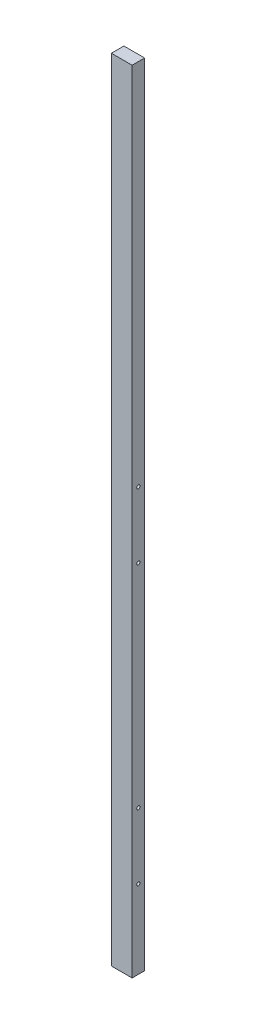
ISO-10303-21;
HEADER;
FILE_DESCRIPTION(('STEP AP214'),'2;1');
FILE_NAME('part.step','',(''),(''),'','','');
FILE_SCHEMA(('AUTOMOTIVE_DESIGN { 1 0 10303 214 1 1 1 1 }'));
ENDSEC;
DATA;
#1=APPLICATION_CONTEXT('core data for automotive mechanical design processes');
#2=APPLICATION_PROTOCOL_DEFINITION('international standard','automotive_design',2000,#1);
#3=PRODUCT_CONTEXT('',#1,'mechanical');
#4=PRODUCT('Part','Part','',(#3));
#5=PRODUCT_RELATED_PRODUCT_CATEGORY('part','',(#4));
#6=PRODUCT_DEFINITION_FORMATION('','',#4);
#7=PRODUCT_DEFINITION_CONTEXT('part definition',#1,'design');
#8=PRODUCT_DEFINITION('design','',#6,#7);
#9=PRODUCT_DEFINITION_SHAPE('','',#8);
#10=(LENGTH_UNIT() NAMED_UNIT(*) SI_UNIT(.MILLI.,.METRE.));
#11=(NAMED_UNIT(*) PLANE_ANGLE_UNIT() SI_UNIT($,.RADIAN.));
#12=(NAMED_UNIT(*) SI_UNIT($,.STERADIAN.) SOLID_ANGLE_UNIT());
#13=UNCERTAINTY_MEASURE_WITH_UNIT(LENGTH_MEASURE(1.E-05),#10,'distance_accuracy_value','');
#14=(GEOMETRIC_REPRESENTATION_CONTEXT(3) GLOBAL_UNCERTAINTY_ASSIGNED_CONTEXT((#13)) GLOBAL_UNIT_ASSIGNED_CONTEXT((#10,
#11,#12)) REPRESENTATION_CONTEXT('',''));
#15=CARTESIAN_POINT('',(0.,0.,0.));
#16=DIRECTION('',(0.,0.,1.));
#17=DIRECTION('',(1.,0.,0.));
#18=AXIS2_PLACEMENT_3D('',#15,#16,#17);
#19=CARTESIAN_POINT('',(0.,0.,38.));
#20=DIRECTION('',(1.,0.,0.));
#21=DIRECTION('',(0.,0.,-1.));
#22=AXIS2_PLACEMENT_3D('',#19,#20,#21);
#23=PLANE('',#22);
#24=CARTESIAN_POINT('',(0.,238.,18.9999999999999));
#25=DIRECTION('',(1.,0.,0.));
#26=DIRECTION('',(0.,0.,-1.));
#27=AXIS2_PLACEMENT_3D('',#24,#25,#26);
#28=CIRCLE('',#27,5.);
#29=CARTESIAN_POINT('',(0.,238.,13.9999999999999));
#30=VERTEX_POINT('',#29);
#31=EDGE_CURVE('E99',#30,#30,#28,.F.);
#32=ORIENTED_EDGE('',*,*,#31,.F.);
#33=EDGE_LOOP('',(#32));
#34=FACE_BOUND('',#33,.T.);
#35=CARTESIAN_POINT('',(0.,437.999999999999,18.9999999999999));
#36=DIRECTION('',(1.,0.,0.));
#37=DIRECTION('',(0.,0.,-1.));
#38=AXIS2_PLACEMENT_3D('',#35,#36,#37);
#39=CIRCLE('',#38,5.);
#40=CARTESIAN_POINT('',(0.,437.999999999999,13.9999999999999));
#41=VERTEX_POINT('',#40);
#42=EDGE_CURVE('E123',#41,#41,#39,.F.);
#43=ORIENTED_EDGE('',*,*,#42,.F.);
#44=EDGE_LOOP('',(#43));
#45=FACE_BOUND('',#44,.T.);
#46=CARTESIAN_POINT('',(0.,1082.,18.9999999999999));
#47=DIRECTION('',(1.,0.,0.));
#48=DIRECTION('',(0.,0.,-1.));
#49=AXIS2_PLACEMENT_3D('',#46,#47,#48);
#50=CIRCLE('',#49,5.);
#51=CARTESIAN_POINT('',(0.,1082.,13.9999999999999));
#52=VERTEX_POINT('',#51);
#53=EDGE_CURVE('E117',#52,#52,#50,.F.);
#54=ORIENTED_EDGE('',*,*,#53,.F.);
#55=EDGE_LOOP('',(#54));
#56=FACE_BOUND('',#55,.T.);
#57=CARTESIAN_POINT('',(0.,1282.,18.9999999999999));
#58=DIRECTION('',(1.,0.,0.));
#59=DIRECTION('',(0.,0.,-1.));
#60=AXIS2_PLACEMENT_3D('',#57,#58,#59);
#61=CIRCLE('',#60,5.);
#62=CARTESIAN_POINT('',(0.,1282.,13.9999999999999));
#63=VERTEX_POINT('',#62);
#64=EDGE_CURVE('E110',#63,#63,#61,.F.);
#65=ORIENTED_EDGE('',*,*,#64,.F.);
#66=EDGE_LOOP('',(#65));
#67=FACE_BOUND('',#66,.T.);
#68=DIRECTION('',(0.,-1.,0.));
#69=VECTOR('',#68,1.);
#70=CARTESIAN_POINT('',(0.,0.,0.));
#71=LINE('',#70,#69);
#72=CARTESIAN_POINT('',(0.,2400.,0.));
#73=VERTEX_POINT('',#72);
#74=CARTESIAN_POINT('',(0.,0.,0.));
#75=VERTEX_POINT('',#74);
#76=EDGE_CURVE('E96',#73,#75,#71,.T.);
#77=ORIENTED_EDGE('',*,*,#76,.T.);
#78=DIRECTION('',(0.,0.,-1.));
#79=VECTOR('',#78,1.);
#80=CARTESIAN_POINT('',(0.,0.,38.));
#81=LINE('',#80,#79);
#82=CARTESIAN_POINT('',(0.,0.,38.));
#83=VERTEX_POINT('',#82);
#84=EDGE_CURVE('E11',#83,#75,#81,.T.);
#85=ORIENTED_EDGE('',*,*,#84,.F.);
#86=DIRECTION('',(0.,-1.,0.));
#87=VECTOR('',#86,1.);
#88=CARTESIAN_POINT('',(0.,0.,38.));
#89=LINE('',#88,#87);
#90=CARTESIAN_POINT('',(0.,2400.,38.));
#91=VERTEX_POINT('',#90);
#92=EDGE_CURVE('E84',#91,#83,#89,.T.);
#93=ORIENTED_EDGE('',*,*,#92,.F.);
#94=DIRECTION('',(0.,0.,-1.));
#95=VECTOR('',#94,1.);
#96=CARTESIAN_POINT('',(0.,2400.,38.));
#97=LINE('',#96,#95);
#98=EDGE_CURVE('E92',#91,#73,#97,.T.);
#99=ORIENTED_EDGE('',*,*,#98,.T.);
#100=EDGE_LOOP('',(#77,#85,#93,#99));
#101=FACE_BOUND('',#100,.T.);
#102=ADVANCED_FACE('F33',(#34,#45,#56,#67,#101),#23,.F.);
#103=CARTESIAN_POINT('',(0.,0.,38.));
#104=DIRECTION('',(0.,1.,0.));
#105=DIRECTION('',(0.,0.,1.));
#106=AXIS2_PLACEMENT_3D('',#103,#104,#105);
#107=PLANE('',#106);
#108=DIRECTION('',(1.,0.,0.));
#109=VECTOR('',#108,1.);
#110=CARTESIAN_POINT('',(0.,0.,0.));
#111=LINE('',#110,#109);
#112=CARTESIAN_POINT('',(63.,0.,0.));
#113=VERTEX_POINT('',#112);
#114=EDGE_CURVE('E88',#75,#113,#111,.T.);
#115=ORIENTED_EDGE('',*,*,#114,.T.);
#116=DIRECTION('',(0.,0.,-1.));
#117=VECTOR('',#116,1.);
#118=CARTESIAN_POINT('',(63.,0.,38.));
#119=LINE('',#118,#117);
#120=CARTESIAN_POINT('',(63.,0.,38.));
#121=VERTEX_POINT('',#120);
#122=EDGE_CURVE('E41',#121,#113,#119,.T.);
#123=ORIENTED_EDGE('',*,*,#122,.F.);
#124=DIRECTION('',(1.,0.,0.));
#125=VECTOR('',#124,1.);
#126=CARTESIAN_POINT('',(0.,0.,38.));
#127=LINE('',#126,#125);
#128=EDGE_CURVE('E79',#83,#121,#127,.T.);
#129=ORIENTED_EDGE('',*,*,#128,.F.);
#130=ORIENTED_EDGE('',*,*,#84,.T.);
#131=EDGE_LOOP('',(#115,#123,#129,#130));
#132=FACE_BOUND('',#131,.T.);
#133=ADVANCED_FACE('F87',(#132),#107,.F.);
#134=CARTESIAN_POINT('',(63.,0.,38.));
#135=DIRECTION('',(-1.,0.,0.));
#136=DIRECTION('',(0.,0.,1.));
#137=AXIS2_PLACEMENT_3D('',#134,#135,#136);
#138=PLANE('',#137);
#139=CARTESIAN_POINT('',(63.,238.,18.9999999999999));
#140=DIRECTION('',(1.,0.,0.));
#141=DIRECTION('',(0.,0.,-1.));
#142=AXIS2_PLACEMENT_3D('',#139,#140,#141);
#143=CIRCLE('',#142,5.);
#144=CARTESIAN_POINT('',(63.,238.,13.9999999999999));
#145=VERTEX_POINT('',#144);
#146=EDGE_CURVE('E126',#145,#145,#143,.T.);
#147=ORIENTED_EDGE('',*,*,#146,.F.);
#148=EDGE_LOOP('',(#147));
#149=FACE_BOUND('',#148,.T.);
#150=CARTESIAN_POINT('',(63.,437.999999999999,18.9999999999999));
#151=DIRECTION('',(1.,0.,0.));
#152=DIRECTION('',(0.,0.,-1.));
#153=AXIS2_PLACEMENT_3D('',#150,#151,#152);
#154=CIRCLE('',#153,5.);
#155=CARTESIAN_POINT('',(63.,437.999999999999,13.9999999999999));
#156=VERTEX_POINT('',#155);
#157=EDGE_CURVE('E120',#156,#156,#154,.T.);
#158=ORIENTED_EDGE('',*,*,#157,.F.);
#159=EDGE_LOOP('',(#158));
#160=FACE_BOUND('',#159,.T.);
#161=CARTESIAN_POINT('',(63.,1082.,18.9999999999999));
#162=DIRECTION('',(1.,0.,0.));
#163=DIRECTION('',(0.,0.,-1.));
#164=AXIS2_PLACEMENT_3D('',#161,#162,#163);
#165=CIRCLE('',#164,5.);
#166=CARTESIAN_POINT('',(63.,1082.,13.9999999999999));
#167=VERTEX_POINT('',#166);
#168=EDGE_CURVE('E113',#167,#167,#165,.T.);
#169=ORIENTED_EDGE('',*,*,#168,.F.);
#170=EDGE_LOOP('',(#169));
#171=FACE_BOUND('',#170,.T.);
#172=CARTESIAN_POINT('',(63.,1282.,18.9999999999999));
#173=DIRECTION('',(1.,0.,0.));
#174=DIRECTION('',(0.,0.,-1.));
#175=AXIS2_PLACEMENT_3D('',#172,#173,#174);
#176=CIRCLE('',#175,5.);
#177=CARTESIAN_POINT('',(63.,1282.,13.9999999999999));
#178=VERTEX_POINT('',#177);
#179=EDGE_CURVE('E114',#178,#178,#176,.T.);
#180=ORIENTED_EDGE('',*,*,#179,.F.);
#181=EDGE_LOOP('',(#180));
#182=FACE_BOUND('',#181,.T.);
#183=DIRECTION('',(0.,1.,0.));
#184=VECTOR('',#183,1.);
#185=CARTESIAN_POINT('',(63.,0.,0.));
#186=LINE('',#185,#184);
#187=CARTESIAN_POINT('',(63.,2400.,0.));
#188=VERTEX_POINT('',#187);
#189=EDGE_CURVE('E66',#113,#188,#186,.T.);
#190=ORIENTED_EDGE('',*,*,#189,.T.);
#191=DIRECTION('',(0.,0.,-1.));
#192=VECTOR('',#191,1.);
#193=CARTESIAN_POINT('',(63.,2400.,38.));
#194=LINE('',#193,#192);
#195=CARTESIAN_POINT('',(63.,2400.,38.));
#196=VERTEX_POINT('',#195);
#197=EDGE_CURVE('E89',#196,#188,#194,.T.);
#198=ORIENTED_EDGE('',*,*,#197,.F.);
#199=DIRECTION('',(0.,1.,0.));
#200=VECTOR('',#199,1.);
#201=CARTESIAN_POINT('',(63.,0.,38.));
#202=LINE('',#201,#200);
#203=EDGE_CURVE('E82',#121,#196,#202,.T.);
#204=ORIENTED_EDGE('',*,*,#203,.F.);
#205=ORIENTED_EDGE('',*,*,#122,.T.);
#206=EDGE_LOOP('',(#190,#198,#204,#205));
#207=FACE_BOUND('',#206,.T.);
#208=ADVANCED_FACE('F90',(#149,#160,#171,#182,#207),#138,.F.);
#209=CARTESIAN_POINT('',(0.,2400.,38.));
#210=DIRECTION('',(0.,-1.,0.));
#211=DIRECTION('',(0.,0.,-1.));
#212=AXIS2_PLACEMENT_3D('',#209,#210,#211);
#213=PLANE('',#212);
#214=DIRECTION('',(-1.,0.,0.));
#215=VECTOR('',#214,1.);
#216=CARTESIAN_POINT('',(0.,2400.,0.));
#217=LINE('',#216,#215);
#218=EDGE_CURVE('E72',#188,#73,#217,.T.);
#219=ORIENTED_EDGE('',*,*,#218,.T.);
#220=ORIENTED_EDGE('',*,*,#98,.F.);
#221=DIRECTION('',(-1.,0.,0.));
#222=VECTOR('',#221,1.);
#223=CARTESIAN_POINT('',(0.,2400.,38.));
#224=LINE('',#223,#222);
#225=EDGE_CURVE('E49',#196,#91,#224,.T.);
#226=ORIENTED_EDGE('',*,*,#225,.F.);
#227=ORIENTED_EDGE('',*,*,#197,.T.);
#228=EDGE_LOOP('',(#219,#220,#226,#227));
#229=FACE_BOUND('',#228,.T.);
#230=ADVANCED_FACE('F104',(#229),#213,.F.);
#231=CARTESIAN_POINT('',(0.,0.,38.));
#232=DIRECTION('',(0.,0.,-1.));
#233=DIRECTION('',(-1.,0.,0.));
#234=AXIS2_PLACEMENT_3D('',#231,#232,#233);
#235=PLANE('',#234);
#236=ORIENTED_EDGE('',*,*,#92,.T.);
#237=ORIENTED_EDGE('',*,*,#128,.T.);
#238=ORIENTED_EDGE('',*,*,#203,.T.);
#239=ORIENTED_EDGE('',*,*,#225,.T.);
#240=EDGE_LOOP('',(#236,#237,#238,#239));
#241=FACE_BOUND('',#240,.T.);
#242=ADVANCED_FACE('F80',(#241),#235,.F.);
#243=CARTESIAN_POINT('',(0.,0.,0.));
#244=DIRECTION('',(0.,0.,-1.));
#245=DIRECTION('',(-1.,0.,0.));
#246=AXIS2_PLACEMENT_3D('',#243,#244,#245);
#247=PLANE('',#246);
#248=ORIENTED_EDGE('',*,*,#76,.F.);
#249=ORIENTED_EDGE('',*,*,#218,.F.);
#250=ORIENTED_EDGE('',*,*,#189,.F.);
#251=ORIENTED_EDGE('',*,*,#114,.F.);
#252=EDGE_LOOP('',(#248,#249,#250,#251));
#253=FACE_BOUND('',#252,.T.);
#254=ADVANCED_FACE('F107',(#253),#247,.T.);
#255=CARTESIAN_POINT('',(-0.001000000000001,1282.,18.9999999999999));
#256=DIRECTION('',(1.,0.,0.));
#257=DIRECTION('',(0.,0.,-1.));
#258=AXIS2_PLACEMENT_3D('',#255,#256,#257);
#259=CYLINDRICAL_SURFACE('',#258,5.);
#260=ORIENTED_EDGE('',*,*,#179,.T.);
#261=EDGE_LOOP('',(#260));
#262=FACE_BOUND('',#261,.T.);
#263=ORIENTED_EDGE('',*,*,#64,.T.);
#264=EDGE_LOOP('',(#263));
#265=FACE_BOUND('',#264,.T.);
#266=ADVANCED_FACE('F146',(#262,#265),#259,.F.);
#267=CARTESIAN_POINT('',(-0.001000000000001,1082.,18.9999999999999));
#268=DIRECTION('',(1.,0.,0.));
#269=DIRECTION('',(0.,0.,-1.));
#270=AXIS2_PLACEMENT_3D('',#267,#268,#269);
#271=CYLINDRICAL_SURFACE('',#270,5.);
#272=ORIENTED_EDGE('',*,*,#168,.T.);
#273=EDGE_LOOP('',(#272));
#274=FACE_BOUND('',#273,.T.);
#275=ORIENTED_EDGE('',*,*,#53,.T.);
#276=EDGE_LOOP('',(#275));
#277=FACE_BOUND('',#276,.T.);
#278=ADVANCED_FACE('F149',(#274,#277),#271,.F.);
#279=CARTESIAN_POINT('',(-0.001000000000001,437.999999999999,18.9999999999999));
#280=DIRECTION('',(1.,0.,0.));
#281=DIRECTION('',(0.,0.,-1.));
#282=AXIS2_PLACEMENT_3D('',#279,#280,#281);
#283=CYLINDRICAL_SURFACE('',#282,5.);
#284=ORIENTED_EDGE('',*,*,#157,.T.);
#285=EDGE_LOOP('',(#284));
#286=FACE_BOUND('',#285,.T.);
#287=ORIENTED_EDGE('',*,*,#42,.T.);
#288=EDGE_LOOP('',(#287));
#289=FACE_BOUND('',#288,.T.);
#290=ADVANCED_FACE('F165',(#286,#289),#283,.F.);
#291=CARTESIAN_POINT('',(-0.001000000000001,238.,18.9999999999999));
#292=DIRECTION('',(1.,0.,0.));
#293=DIRECTION('',(0.,0.,-1.));
#294=AXIS2_PLACEMENT_3D('',#291,#292,#293);
#295=CYLINDRICAL_SURFACE('',#294,5.);
#296=ORIENTED_EDGE('',*,*,#146,.T.);
#297=EDGE_LOOP('',(#296));
#298=FACE_BOUND('',#297,.T.);
#299=ORIENTED_EDGE('',*,*,#31,.T.);
#300=EDGE_LOOP('',(#299));
#301=FACE_BOUND('',#300,.T.);
#302=ADVANCED_FACE('F134',(#298,#301),#295,.F.);
#303=CLOSED_SHELL('',(#102,#133,#208,#230,#242,#254,#266,#278,#290,#302));
#304=MANIFOLD_SOLID_BREP('B2',#303);
#305=ADVANCED_BREP_SHAPE_REPRESENTATION('',(#18,#304),#14);
#306=SHAPE_DEFINITION_REPRESENTATION(#9,#305);
ENDSEC;
END-ISO-10303-21;
